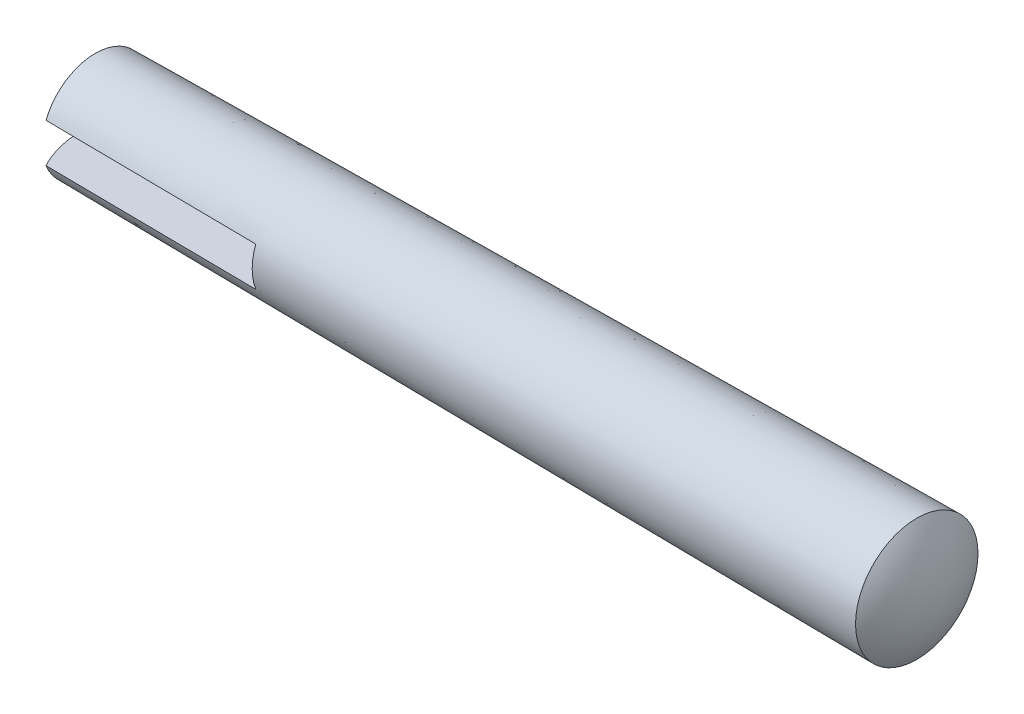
ISO-10303-21;
HEADER;
FILE_DESCRIPTION(('STEP AP214'),'2;1');
FILE_NAME('part.step','',(''),(''),'','','');
FILE_SCHEMA(('AUTOMOTIVE_DESIGN { 1 0 10303 214 1 1 1 1 }'));
ENDSEC;
DATA;
#1=APPLICATION_CONTEXT('core data for automotive mechanical design processes');
#2=APPLICATION_PROTOCOL_DEFINITION('international standard','automotive_design',2000,#1);
#3=PRODUCT_CONTEXT('',#1,'mechanical');
#4=PRODUCT('Part','Part','',(#3));
#5=PRODUCT_RELATED_PRODUCT_CATEGORY('part','',(#4));
#6=PRODUCT_DEFINITION_FORMATION('','',#4);
#7=PRODUCT_DEFINITION_CONTEXT('part definition',#1,'design');
#8=PRODUCT_DEFINITION('design','',#6,#7);
#9=PRODUCT_DEFINITION_SHAPE('','',#8);
#10=(LENGTH_UNIT() NAMED_UNIT(*) SI_UNIT(.MILLI.,.METRE.));
#11=(NAMED_UNIT(*) PLANE_ANGLE_UNIT() SI_UNIT($,.RADIAN.));
#12=(NAMED_UNIT(*) SI_UNIT($,.STERADIAN.) SOLID_ANGLE_UNIT());
#13=UNCERTAINTY_MEASURE_WITH_UNIT(LENGTH_MEASURE(1.E-05),#10,'distance_accuracy_value','');
#14=(GEOMETRIC_REPRESENTATION_CONTEXT(3) GLOBAL_UNCERTAINTY_ASSIGNED_CONTEXT((#13)) GLOBAL_UNIT_ASSIGNED_CONTEXT((#10,
#11,#12)) REPRESENTATION_CONTEXT('',''));
#15=CARTESIAN_POINT('',(0.,0.,0.));
#16=DIRECTION('',(0.,0.,1.));
#17=DIRECTION('',(1.,0.,0.));
#18=AXIS2_PLACEMENT_3D('',#15,#16,#17);
#19=CARTESIAN_POINT('',(4.33012701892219,0.,0.));
#20=DIRECTION('',(-1.,0.,0.));
#21=DIRECTION('',(0.,1.,0.));
#22=AXIS2_PLACEMENT_3D('',#19,#20,#21);
#23=SPHERICAL_SURFACE('',#22,5.);
#24=CARTESIAN_POINT('',(4.33012701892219,-0.925107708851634,0.));
#25=DIRECTION('',(0.,1.,0.));
#26=DIRECTION('',(0.,0.,1.));
#27=AXIS2_PLACEMENT_3D('',#24,#25,#26);
#28=CIRCLE('',#27,4.91367232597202);
#29=CARTESIAN_POINT('',(0.,-0.925107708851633,-2.32253648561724));
#30=VERTEX_POINT('',#29);
#31=CARTESIAN_POINT('',(0.,-0.925107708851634,2.32253648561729));
#32=VERTEX_POINT('',#31);
#33=EDGE_CURVE('E81',#30,#32,#28,.T.);
#34=ORIENTED_EDGE('',*,*,#33,.F.);
#35=CARTESIAN_POINT('',(0.,0.,0.));
#36=DIRECTION('',(-1.,0.,0.));
#37=DIRECTION('',(0.,0.,1.));
#38=AXIS2_PLACEMENT_3D('',#35,#36,#37);
#39=CIRCLE('',#38,2.5);
#40=EDGE_CURVE('E102',#30,#32,#39,.T.);
#41=ORIENTED_EDGE('',*,*,#40,.T.);
#42=EDGE_LOOP('',(#34,#41));
#43=FACE_BOUND('',#42,.T.);
#44=ADVANCED_FACE('F33',(#43),#23,.T.);
#45=CARTESIAN_POINT('',(4.33012701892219,0.925107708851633,0.));
#46=DIRECTION('',(0.,-1.,0.));
#47=DIRECTION('',(0.,0.,-1.));
#48=AXIS2_PLACEMENT_3D('',#45,#46,#47);
#49=CIRCLE('',#48,4.91367232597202);
#50=CARTESIAN_POINT('',(0.,0.925107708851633,2.32253648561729));
#51=VERTEX_POINT('',#50);
#52=CARTESIAN_POINT('',(0.,0.925107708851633,-2.32253648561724));
#53=VERTEX_POINT('',#52);
#54=EDGE_CURVE('E110',#51,#53,#49,.T.);
#55=ORIENTED_EDGE('',*,*,#54,.F.);
#56=EDGE_CURVE('E99',#51,#53,#39,.T.);
#57=ORIENTED_EDGE('',*,*,#56,.T.);
#58=EDGE_LOOP('',(#55,#57));
#59=FACE_BOUND('',#58,.T.);
#60=ADVANCED_FACE('F114',(#59),#23,.T.);
#61=CARTESIAN_POINT('',(38.74,0.,0.));
#62=DIRECTION('',(1.,0.,0.));
#63=DIRECTION('',(0.,0.,-1.));
#64=AXIS2_PLACEMENT_3D('',#61,#62,#63);
#65=CONICAL_SURFACE('',#64,2.88739999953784,0.00999966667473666);
#66=CARTESIAN_POINT('',(38.74,0.,0.));
#67=DIRECTION('',(-1.,0.,0.));
#68=DIRECTION('',(0.,0.,1.));
#69=AXIS2_PLACEMENT_3D('',#66,#67,#68);
#70=CIRCLE('',#69,2.88739999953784);
#71=CARTESIAN_POINT('',(38.74,0.,2.88739999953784));
#72=VERTEX_POINT('',#71);
#73=EDGE_CURVE('E105',#72,#72,#70,.T.);
#74=ORIENTED_EDGE('',*,*,#73,.T.);
#75=EDGE_LOOP('',(#74));
#76=FACE_BOUND('',#75,.T.);
#77=CARTESIAN_POINT('',(-4.33933013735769,-0.925107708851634,2.27576189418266));
#78=CARTESIAN_POINT('',(-2.68514700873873,-0.925107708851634,2.29361806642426));
#79=CARTESIAN_POINT('',(-1.0309635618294,-0.925107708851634,2.31144471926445));
#80=CARTESIAN_POINT('',(2.27740393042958,-0.925107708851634,2.3470424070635));
#81=CARTESIAN_POINT('',(3.93158797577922,-0.925107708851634,2.36481344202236));
#82=CARTESIAN_POINT('',(12.2025096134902,-0.925107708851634,2.45353812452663));
#83=CARTESIAN_POINT('',(18.8192514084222,-0.925107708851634,2.52410029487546));
#84=CARTESIAN_POINT('',(25.4359964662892,-0.925107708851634,2.59435435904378));
#85=B_SPLINE_CURVE_WITH_KNOTS('',3,(#77,#78,#79,#80,#81,#82,#83,#84),.UNSPECIFIED.,.F.,.F.,(4,2,
2,4),(0.,4.96283850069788,9.92567700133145,29.7770310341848),.UNSPECIFIED.);
#86=CARTESIAN_POINT('',(10.,-0.925107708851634,2.42985096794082));
#87=VERTEX_POINT('',#86);
#88=EDGE_CURVE('E11',#32,#87,#85,.T.);
#89=ORIENTED_EDGE('',*,*,#88,.F.);
#90=ORIENTED_EDGE('',*,*,#40,.F.);
#91=CARTESIAN_POINT('',(-4.33933013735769,-0.925107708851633,-2.27576189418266));
#92=CARTESIAN_POINT('',(-2.68514700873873,-0.925107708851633,-2.29361806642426));
#93=CARTESIAN_POINT('',(-1.0309635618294,-0.925107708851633,-2.31144471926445));
#94=CARTESIAN_POINT('',(2.27740393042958,-0.925107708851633,-2.3470424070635));
#95=CARTESIAN_POINT('',(3.93158797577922,-0.925107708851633,-2.36481344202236));
#96=CARTESIAN_POINT('',(12.2025096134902,-0.925107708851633,-2.45353812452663));
#97=CARTESIAN_POINT('',(18.8192514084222,-0.925107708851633,-2.52410029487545));
#98=CARTESIAN_POINT('',(25.4359964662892,-0.925107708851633,-2.59435435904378));
#99=B_SPLINE_CURVE_WITH_KNOTS('',3,(#91,#92,#93,#94,#95,#96,#97,#98),.UNSPECIFIED.,.F.,.F.,(4,2,
2,4),(0.,4.96283850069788,9.92567700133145,29.7770310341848),.UNSPECIFIED.);
#100=CARTESIAN_POINT('',(10.,-0.925107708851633,-2.42985096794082));
#101=VERTEX_POINT('',#100);
#102=EDGE_CURVE('E62',#101,#30,#99,.F.);
#103=ORIENTED_EDGE('',*,*,#102,.F.);
#104=CARTESIAN_POINT('',(10.,0.,0.));
#105=DIRECTION('',(1.,0.,0.));
#106=DIRECTION('',(0.,0.,-1.));
#107=AXIS2_PLACEMENT_3D('',#104,#105,#106);
#108=CIRCLE('',#107,2.5999999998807);
#109=CARTESIAN_POINT('',(10.,0.925107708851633,-2.42985096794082));
#110=VERTEX_POINT('',#109);
#111=EDGE_CURVE('E89',#101,#110,#108,.T.);
#112=ORIENTED_EDGE('',*,*,#111,.T.);
#113=CARTESIAN_POINT('',(-4.33933013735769,0.925107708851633,-2.27576189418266));
#114=CARTESIAN_POINT('',(-2.68514700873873,0.925107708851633,-2.29361806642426));
#115=CARTESIAN_POINT('',(-1.0309635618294,0.925107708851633,-2.31144471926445));
#116=CARTESIAN_POINT('',(2.27740393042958,0.925107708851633,-2.3470424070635));
#117=CARTESIAN_POINT('',(3.93158797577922,0.925107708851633,-2.36481344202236));
#118=CARTESIAN_POINT('',(12.2025096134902,0.925107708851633,-2.45353812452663));
#119=CARTESIAN_POINT('',(18.8192514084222,0.925107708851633,-2.52410029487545));
#120=CARTESIAN_POINT('',(25.4359964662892,0.925107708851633,-2.59435435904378));
#121=B_SPLINE_CURVE_WITH_KNOTS('',3,(#113,#114,#115,#116,#117,#118,#119,#120),.UNSPECIFIED.,.F.,
.F.,(4,2,2,4),(0.,4.96283850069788,9.92567700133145,29.7770310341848),.UNSPECIFIED.);
#122=EDGE_CURVE('E95',#53,#110,#121,.T.);
#123=ORIENTED_EDGE('',*,*,#122,.F.);
#124=ORIENTED_EDGE('',*,*,#56,.F.);
#125=CARTESIAN_POINT('',(-4.33933013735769,0.925107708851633,2.27576189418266));
#126=CARTESIAN_POINT('',(-2.68514700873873,0.925107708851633,2.29361806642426));
#127=CARTESIAN_POINT('',(-1.0309635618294,0.925107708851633,2.31144471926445));
#128=CARTESIAN_POINT('',(2.27740393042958,0.925107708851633,2.3470424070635));
#129=CARTESIAN_POINT('',(3.93158797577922,0.925107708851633,2.36481344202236));
#130=CARTESIAN_POINT('',(12.2025096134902,0.925107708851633,2.45353812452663));
#131=CARTESIAN_POINT('',(18.8192514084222,0.925107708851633,2.52410029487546));
#132=CARTESIAN_POINT('',(25.4359964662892,0.925107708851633,2.59435435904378));
#133=B_SPLINE_CURVE_WITH_KNOTS('',3,(#125,#126,#127,#128,#129,#130,#131,#132),.UNSPECIFIED.,.F.,
.F.,(4,2,2,4),(0.,4.96283850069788,9.92567700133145,29.7770310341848),.UNSPECIFIED.);
#134=CARTESIAN_POINT('',(10.,0.925107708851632,2.42985096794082));
#135=VERTEX_POINT('',#134);
#136=EDGE_CURVE('E47',#135,#51,#133,.F.);
#137=ORIENTED_EDGE('',*,*,#136,.F.);
#138=EDGE_CURVE('E87',#135,#87,#108,.T.);
#139=ORIENTED_EDGE('',*,*,#138,.T.);
#140=EDGE_LOOP('',(#89,#90,#103,#112,#123,#124,#137,#139));
#141=FACE_BOUND('',#140,.T.);
#142=ADVANCED_FACE('F92',(#76,#141),#65,.T.);
#143=CARTESIAN_POINT('',(34.657975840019,0.,0.));
#144=DIRECTION('',(-1.,0.,0.));
#145=DIRECTION('',(0.,-1.,0.));
#146=AXIS2_PLACEMENT_3D('',#143,#144,#145);
#147=SPHERICAL_SURFACE('',#146,5.);
#148=ORIENTED_EDGE('',*,*,#73,.F.);
#149=EDGE_LOOP('',(#148));
#150=FACE_BOUND('',#149,.T.);
#151=ADVANCED_FACE('F35',(#150),#147,.T.);
#152=CARTESIAN_POINT('',(10.,-0.925107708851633,-2.88739999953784));
#153=DIRECTION('',(0.,1.,0.));
#154=DIRECTION('',(0.,0.,1.));
#155=AXIS2_PLACEMENT_3D('',#152,#153,#154);
#156=PLANE('',#155);
#157=ORIENTED_EDGE('',*,*,#102,.T.);
#158=ORIENTED_EDGE('',*,*,#33,.T.);
#159=ORIENTED_EDGE('',*,*,#88,.T.);
#160=DIRECTION('',(0.,0.,-1.));
#161=VECTOR('',#160,1.);
#162=CARTESIAN_POINT('',(10.,-0.925107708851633,-2.88739999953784));
#163=LINE('',#162,#161);
#164=EDGE_CURVE('E80',#87,#101,#163,.T.);
#165=ORIENTED_EDGE('',*,*,#164,.T.);
#166=EDGE_LOOP('',(#157,#158,#159,#165));
#167=FACE_BOUND('',#166,.T.);
#168=ADVANCED_FACE('F79',(#167),#156,.T.);
#169=CARTESIAN_POINT('',(10.,0.925107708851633,-2.88739999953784));
#170=DIRECTION('',(0.,-1.,0.));
#171=DIRECTION('',(0.,0.,-1.));
#172=AXIS2_PLACEMENT_3D('',#169,#170,#171);
#173=PLANE('',#172);
#174=ORIENTED_EDGE('',*,*,#122,.T.);
#175=DIRECTION('',(0.,0.,1.));
#176=VECTOR('',#175,1.);
#177=CARTESIAN_POINT('',(10.,0.925107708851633,-2.88739999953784));
#178=LINE('',#177,#176);
#179=EDGE_CURVE('E54',#110,#135,#178,.T.);
#180=ORIENTED_EDGE('',*,*,#179,.T.);
#181=ORIENTED_EDGE('',*,*,#136,.T.);
#182=ORIENTED_EDGE('',*,*,#54,.T.);
#183=EDGE_LOOP('',(#174,#180,#181,#182));
#184=FACE_BOUND('',#183,.T.);
#185=ADVANCED_FACE('F113',(#184),#173,.T.);
#186=CARTESIAN_POINT('',(10.,0.925107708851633,2.88739999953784));
#187=DIRECTION('',(1.,0.,0.));
#188=DIRECTION('',(0.,0.,-1.));
#189=AXIS2_PLACEMENT_3D('',#186,#187,#188);
#190=PLANE('',#189);
#191=ORIENTED_EDGE('',*,*,#179,.F.);
#192=ORIENTED_EDGE('',*,*,#111,.F.);
#193=ORIENTED_EDGE('',*,*,#164,.F.);
#194=ORIENTED_EDGE('',*,*,#138,.F.);
#195=EDGE_LOOP('',(#191,#192,#193,#194));
#196=FACE_BOUND('',#195,.T.);
#197=ADVANCED_FACE('F86',(#196),#190,.F.);
#198=CLOSED_SHELL('',(#44,#60,#142,#151,#168,#185,#197));
#199=MANIFOLD_SOLID_BREP('B2',#198);
#200=ADVANCED_BREP_SHAPE_REPRESENTATION('',(#18,#199),#14);
#201=SHAPE_DEFINITION_REPRESENTATION(#9,#200);
ENDSEC;
END-ISO-10303-21;
